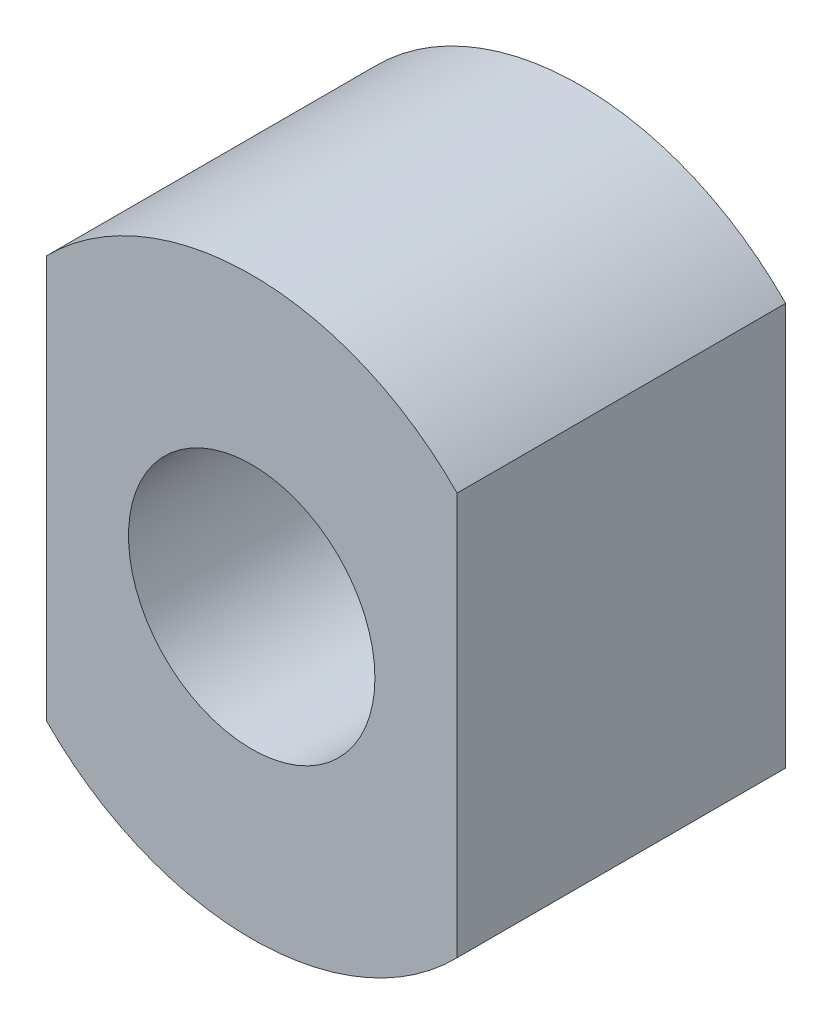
from build123d import *

# Parameters (mm, degrees)
ESQUISSE1_R      = 1.5
EXTRUSION1_DEPTH = 4


with BuildPart() as part:
    # Esquisse1 → Extrusion1 (new body)
    with BuildSketch(Plane.XY):
        with BuildLine():
            Line((-2.5, 2.449489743), (-2.5, -2.449489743))
            ThreePointArc((-2.5, -2.449489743), (0, -3.5), (2.5, -2.449489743))
            Line((2.5, -2.449489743), (2.5, 2.449489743))
            ThreePointArc((2.5, 2.449489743), (0, 3.5), (-2.5, 2.449489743))
        make_face()
        Circle(ESQUISSE1_R, mode=Mode.SUBTRACT)
    extrude(amount=EXTRUSION1_DEPTH)


solid = part.part
